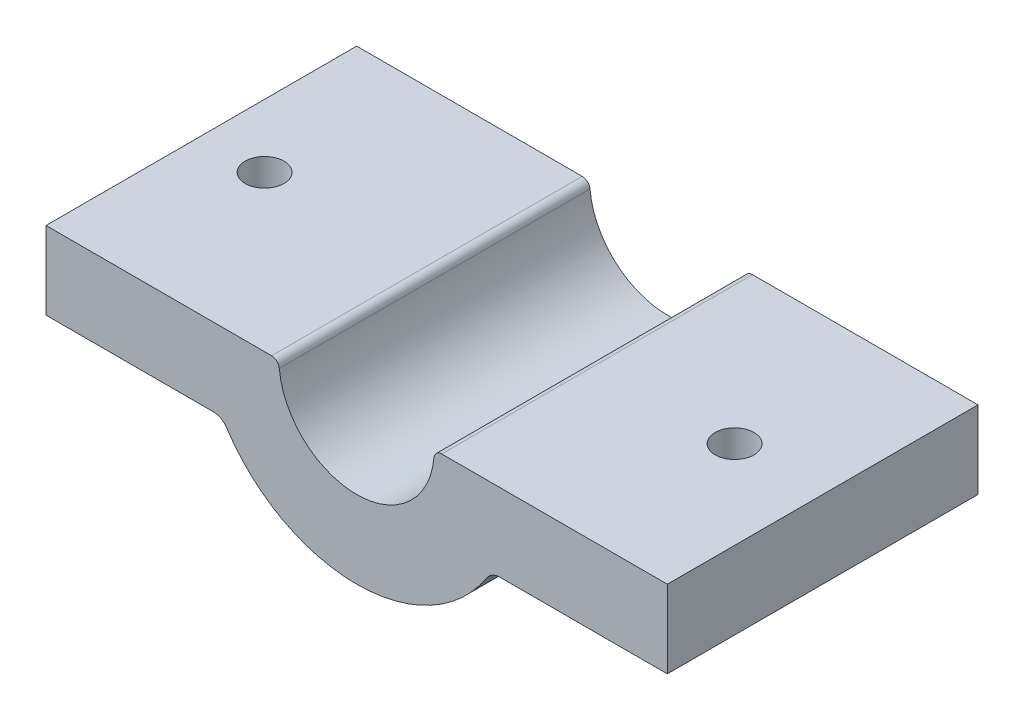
ISO-10303-21;
HEADER;
FILE_DESCRIPTION(('STEP AP214'),'2;1');
FILE_NAME('part.step','',(''),(''),'','','');
FILE_SCHEMA(('AUTOMOTIVE_DESIGN { 1 0 10303 214 1 1 1 1 }'));
ENDSEC;
DATA;
#1=APPLICATION_CONTEXT('core data for automotive mechanical design processes');
#2=APPLICATION_PROTOCOL_DEFINITION('international standard','automotive_design',2000,#1);
#3=PRODUCT_CONTEXT('',#1,'mechanical');
#4=PRODUCT('Part','Part','',(#3));
#5=PRODUCT_RELATED_PRODUCT_CATEGORY('part','',(#4));
#6=PRODUCT_DEFINITION_FORMATION('','',#4);
#7=PRODUCT_DEFINITION_CONTEXT('part definition',#1,'design');
#8=PRODUCT_DEFINITION('design','',#6,#7);
#9=PRODUCT_DEFINITION_SHAPE('','',#8);
#10=(LENGTH_UNIT() NAMED_UNIT(*) SI_UNIT(.MILLI.,.METRE.));
#11=(NAMED_UNIT(*) PLANE_ANGLE_UNIT() SI_UNIT($,.RADIAN.));
#12=(NAMED_UNIT(*) SI_UNIT($,.STERADIAN.) SOLID_ANGLE_UNIT());
#13=UNCERTAINTY_MEASURE_WITH_UNIT(LENGTH_MEASURE(1.E-05),#10,'distance_accuracy_value','');
#14=(GEOMETRIC_REPRESENTATION_CONTEXT(3) GLOBAL_UNCERTAINTY_ASSIGNED_CONTEXT((#13)) GLOBAL_UNIT_ASSIGNED_CONTEXT((#10,
#11,#12)) REPRESENTATION_CONTEXT('',''));
#15=CARTESIAN_POINT('',(0.,0.,0.));
#16=DIRECTION('',(0.,0.,1.));
#17=DIRECTION('',(1.,0.,0.));
#18=AXIS2_PLACEMENT_3D('',#15,#16,#17);
#19=CARTESIAN_POINT('',(-5.47722557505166,-0.5,-20.));
#20=DIRECTION('',(0.,0.,1.));
#21=DIRECTION('',(1.,0.,0.));
#22=AXIS2_PLACEMENT_3D('',#19,#20,#21);
#23=CYLINDRICAL_SURFACE('',#22,0.5);
#24=CARTESIAN_POINT('',(-5.47722557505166,-0.5,0.));
#25=DIRECTION('',(0.,0.,1.));
#26=DIRECTION('',(-1.,0.,0.));
#27=AXIS2_PLACEMENT_3D('',#24,#25,#26);
#28=CIRCLE('',#27,0.5);
#29=CARTESIAN_POINT('',(-4.97929597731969,-0.454545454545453,0.));
#30=VERTEX_POINT('',#29);
#31=CARTESIAN_POINT('',(-5.47722557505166,0.,0.));
#32=VERTEX_POINT('',#31);
#33=EDGE_CURVE('E172',#30,#32,#28,.T.);
#34=ORIENTED_EDGE('',*,*,#33,.F.);
#35=DIRECTION('',(0.,0.,1.));
#36=VECTOR('',#35,1.);
#37=CARTESIAN_POINT('',(-4.97929597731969,-0.454545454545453,-20.));
#38=LINE('',#37,#36);
#39=CARTESIAN_POINT('',(-4.97929597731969,-0.454545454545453,-20.));
#40=VERTEX_POINT('',#39);
#41=EDGE_CURVE('E143',#40,#30,#38,.T.);
#42=ORIENTED_EDGE('',*,*,#41,.F.);
#43=CARTESIAN_POINT('',(-5.47722557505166,-0.5,-20.));
#44=DIRECTION('',(0.,0.,1.));
#45=DIRECTION('',(-1.,0.,0.));
#46=AXIS2_PLACEMENT_3D('',#43,#44,#45);
#47=CIRCLE('',#46,0.5);
#48=CARTESIAN_POINT('',(-5.47722557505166,0.,-20.));
#49=VERTEX_POINT('',#48);
#50=EDGE_CURVE('E137',#40,#49,#47,.T.);
#51=ORIENTED_EDGE('',*,*,#50,.T.);
#52=DIRECTION('',(0.,0.,1.));
#53=VECTOR('',#52,1.);
#54=CARTESIAN_POINT('',(-5.47722557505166,0.,-20.));
#55=LINE('',#54,#53);
#56=EDGE_CURVE('E119',#49,#32,#55,.T.);
#57=ORIENTED_EDGE('',*,*,#56,.T.);
#58=EDGE_LOOP('',(#34,#42,#51,#57));
#59=FACE_BOUND('',#58,.T.);
#60=ADVANCED_FACE('F32',(#59),#23,.T.);
#61=CARTESIAN_POINT('',(0.,0.,-20.));
#62=DIRECTION('',(0.,0.,1.));
#63=DIRECTION('',(1.,0.,0.));
#64=AXIS2_PLACEMENT_3D('',#61,#62,#63);
#65=CYLINDRICAL_SURFACE('',#64,5.);
#66=CARTESIAN_POINT('',(0.,0.,0.));
#67=DIRECTION('',(0.,0.,-1.));
#68=DIRECTION('',(1.,0.,0.));
#69=AXIS2_PLACEMENT_3D('',#66,#67,#68);
#70=CIRCLE('',#69,5.);
#71=CARTESIAN_POINT('',(4.97929597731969,-0.454545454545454,0.));
#72=VERTEX_POINT('',#71);
#73=EDGE_CURVE('E144',#72,#30,#70,.T.);
#74=ORIENTED_EDGE('',*,*,#73,.F.);
#75=DIRECTION('',(0.,0.,1.));
#76=VECTOR('',#75,1.);
#77=CARTESIAN_POINT('',(4.97929597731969,-0.454545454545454,-20.));
#78=LINE('',#77,#76);
#79=CARTESIAN_POINT('',(4.97929597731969,-0.454545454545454,-20.));
#80=VERTEX_POINT('',#79);
#81=EDGE_CURVE('E195',#80,#72,#78,.T.);
#82=ORIENTED_EDGE('',*,*,#81,.F.);
#83=CARTESIAN_POINT('',(0.,0.,-20.));
#84=DIRECTION('',(0.,0.,-1.));
#85=DIRECTION('',(1.,0.,0.));
#86=AXIS2_PLACEMENT_3D('',#83,#84,#85);
#87=CIRCLE('',#86,5.);
#88=EDGE_CURVE('E130',#80,#40,#87,.T.);
#89=ORIENTED_EDGE('',*,*,#88,.T.);
#90=ORIENTED_EDGE('',*,*,#41,.T.);
#91=EDGE_LOOP('',(#74,#82,#89,#90));
#92=FACE_BOUND('',#91,.T.);
#93=ADVANCED_FACE('F254',(#92),#65,.F.);
#94=CARTESIAN_POINT('',(5.47722557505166,-0.5,-20.));
#95=DIRECTION('',(0.,0.,1.));
#96=DIRECTION('',(1.,0.,0.));
#97=AXIS2_PLACEMENT_3D('',#94,#95,#96);
#98=CYLINDRICAL_SURFACE('',#97,0.5);
#99=CARTESIAN_POINT('',(5.47722557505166,-0.5,0.));
#100=DIRECTION('',(0.,0.,1.));
#101=DIRECTION('',(1.,0.,0.));
#102=AXIS2_PLACEMENT_3D('',#99,#100,#101);
#103=CIRCLE('',#102,0.5);
#104=CARTESIAN_POINT('',(5.47722557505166,0.,0.));
#105=VERTEX_POINT('',#104);
#106=EDGE_CURVE('E147',#105,#72,#103,.T.);
#107=ORIENTED_EDGE('',*,*,#106,.F.);
#108=DIRECTION('',(0.,0.,1.));
#109=VECTOR('',#108,1.);
#110=CARTESIAN_POINT('',(5.47722557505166,0.,-20.));
#111=LINE('',#110,#109);
#112=CARTESIAN_POINT('',(5.47722557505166,0.,-20.));
#113=VERTEX_POINT('',#112);
#114=EDGE_CURVE('E197',#113,#105,#111,.T.);
#115=ORIENTED_EDGE('',*,*,#114,.F.);
#116=CARTESIAN_POINT('',(5.47722557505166,-0.5,-20.));
#117=DIRECTION('',(0.,0.,1.));
#118=DIRECTION('',(1.,0.,0.));
#119=AXIS2_PLACEMENT_3D('',#116,#117,#118);
#120=CIRCLE('',#119,0.5);
#121=EDGE_CURVE('E168',#113,#80,#120,.T.);
#122=ORIENTED_EDGE('',*,*,#121,.T.);
#123=ORIENTED_EDGE('',*,*,#81,.T.);
#124=EDGE_LOOP('',(#107,#115,#122,#123));
#125=FACE_BOUND('',#124,.T.);
#126=ADVANCED_FACE('F252',(#125),#98,.T.);
#127=CARTESIAN_POINT('',(5.47722557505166,0.,-20.));
#128=DIRECTION('',(0.,1.,0.));
#129=DIRECTION('',(0.,0.,1.));
#130=AXIS2_PLACEMENT_3D('',#127,#128,#129);
#131=PLANE('',#130);
#132=CARTESIAN_POINT('',(14.3301270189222,0.,-10.));
#133=DIRECTION('',(0.,1.,0.));
#134=DIRECTION('',(0.,0.,1.));
#135=AXIS2_PLACEMENT_3D('',#132,#133,#134);
#136=CIRCLE('',#135,1.25);
#137=CARTESIAN_POINT('',(14.3301270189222,0.,-8.75));
#138=VERTEX_POINT('',#137);
#139=EDGE_CURVE('E150',#138,#138,#136,.T.);
#140=ORIENTED_EDGE('',*,*,#139,.F.);
#141=EDGE_LOOP('',(#140));
#142=FACE_BOUND('',#141,.T.);
#143=DIRECTION('',(-1.,0.,0.));
#144=VECTOR('',#143,1.);
#145=CARTESIAN_POINT('',(5.47722557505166,0.,0.));
#146=LINE('',#145,#144);
#147=CARTESIAN_POINT('',(20.,0.,0.));
#148=VERTEX_POINT('',#147);
#149=EDGE_CURVE('E188',#148,#105,#146,.T.);
#150=ORIENTED_EDGE('',*,*,#149,.F.);
#151=DIRECTION('',(0.,0.,1.));
#152=VECTOR('',#151,1.);
#153=CARTESIAN_POINT('',(20.,0.,-20.));
#154=LINE('',#153,#152);
#155=CARTESIAN_POINT('',(20.,0.,-20.));
#156=VERTEX_POINT('',#155);
#157=EDGE_CURVE('E199',#156,#148,#154,.T.);
#158=ORIENTED_EDGE('',*,*,#157,.F.);
#159=DIRECTION('',(-1.,0.,0.));
#160=VECTOR('',#159,1.);
#161=CARTESIAN_POINT('',(5.47722557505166,0.,-20.));
#162=LINE('',#161,#160);
#163=EDGE_CURVE('E165',#156,#113,#162,.T.);
#164=ORIENTED_EDGE('',*,*,#163,.T.);
#165=ORIENTED_EDGE('',*,*,#114,.T.);
#166=EDGE_LOOP('',(#150,#158,#164,#165));
#167=FACE_BOUND('',#166,.T.);
#168=ADVANCED_FACE('F249',(#142,#167),#131,.T.);
#169=CARTESIAN_POINT('',(20.,0.,-20.));
#170=DIRECTION('',(1.,0.,0.));
#171=DIRECTION('',(0.,0.,-1.));
#172=AXIS2_PLACEMENT_3D('',#169,#170,#171);
#173=PLANE('',#172);
#174=DIRECTION('',(0.,1.,0.));
#175=VECTOR('',#174,1.);
#176=CARTESIAN_POINT('',(20.,0.,0.));
#177=LINE('',#176,#175);
#178=CARTESIAN_POINT('',(20.,-5.,0.));
#179=VERTEX_POINT('',#178);
#180=EDGE_CURVE('E185',#179,#148,#177,.T.);
#181=ORIENTED_EDGE('',*,*,#180,.F.);
#182=DIRECTION('',(0.,0.,1.));
#183=VECTOR('',#182,1.);
#184=CARTESIAN_POINT('',(20.,-5.,-20.));
#185=LINE('',#184,#183);
#186=CARTESIAN_POINT('',(20.,-5.,-20.));
#187=VERTEX_POINT('',#186);
#188=EDGE_CURVE('E201',#187,#179,#185,.T.);
#189=ORIENTED_EDGE('',*,*,#188,.F.);
#190=DIRECTION('',(0.,1.,0.));
#191=VECTOR('',#190,1.);
#192=CARTESIAN_POINT('',(20.,0.,-20.));
#193=LINE('',#192,#191);
#194=EDGE_CURVE('E162',#187,#156,#193,.T.);
#195=ORIENTED_EDGE('',*,*,#194,.T.);
#196=ORIENTED_EDGE('',*,*,#157,.T.);
#197=EDGE_LOOP('',(#181,#189,#195,#196));
#198=FACE_BOUND('',#197,.T.);
#199=ADVANCED_FACE('F244',(#198),#173,.T.);
#200=CARTESIAN_POINT('',(8.66025403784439,-5.,-20.));
#201=DIRECTION('',(0.,-1.,0.));
#202=DIRECTION('',(0.,0.,-1.));
#203=AXIS2_PLACEMENT_3D('',#200,#201,#202);
#204=PLANE('',#203);
#205=CARTESIAN_POINT('',(14.3301270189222,-5.,-10.));
#206=DIRECTION('',(0.,-1.,0.));
#207=DIRECTION('',(0.,0.,-1.));
#208=AXIS2_PLACEMENT_3D('',#205,#206,#207);
#209=CIRCLE('',#208,1.25);
#210=CARTESIAN_POINT('',(14.3301270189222,-5.,-11.25));
#211=VERTEX_POINT('',#210);
#212=EDGE_CURVE('E396',#211,#211,#209,.T.);
#213=ORIENTED_EDGE('',*,*,#212,.F.);
#214=EDGE_LOOP('',(#213));
#215=FACE_BOUND('',#214,.T.);
#216=DIRECTION('',(1.,0.,0.));
#217=VECTOR('',#216,1.);
#218=CARTESIAN_POINT('',(8.66025403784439,-5.,0.));
#219=LINE('',#218,#217);
#220=CARTESIAN_POINT('',(9.21954445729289,-5.,0.));
#221=VERTEX_POINT('',#220);
#222=EDGE_CURVE('E183',#221,#179,#219,.T.);
#223=ORIENTED_EDGE('',*,*,#222,.F.);
#224=DIRECTION('',(0.,0.,-1.));
#225=VECTOR('',#224,1.);
#226=CARTESIAN_POINT('',(9.21954445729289,-5.,-20.));
#227=LINE('',#226,#225);
#228=CARTESIAN_POINT('',(9.21954445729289,-5.,-20.));
#229=VERTEX_POINT('',#228);
#230=EDGE_CURVE('E47',#221,#229,#227,.T.);
#231=ORIENTED_EDGE('',*,*,#230,.T.);
#232=DIRECTION('',(1.,0.,0.));
#233=VECTOR('',#232,1.);
#234=CARTESIAN_POINT('',(8.66025403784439,-5.,-20.));
#235=LINE('',#234,#233);
#236=EDGE_CURVE('E160',#229,#187,#235,.T.);
#237=ORIENTED_EDGE('',*,*,#236,.T.);
#238=ORIENTED_EDGE('',*,*,#188,.T.);
#239=EDGE_LOOP('',(#223,#231,#237,#238));
#240=FACE_BOUND('',#239,.T.);
#241=ADVANCED_FACE('F241',(#215,#240),#204,.T.);
#242=CARTESIAN_POINT('',(0.,0.,-20.));
#243=DIRECTION('',(0.,0.,1.));
#244=DIRECTION('',(1.,0.,0.));
#245=AXIS2_PLACEMENT_3D('',#242,#243,#244);
#246=CYLINDRICAL_SURFACE('',#245,10.);
#247=CARTESIAN_POINT('',(0.,0.,0.));
#248=DIRECTION('',(0.,0.,1.));
#249=DIRECTION('',(1.,0.,0.));
#250=AXIS2_PLACEMENT_3D('',#247,#248,#249);
#251=CIRCLE('',#250,10.);
#252=CARTESIAN_POINT('',(-8.38140405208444,-5.45454545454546,0.));
#253=VERTEX_POINT('',#252);
#254=CARTESIAN_POINT('',(8.38140405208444,-5.45454545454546,0.));
#255=VERTEX_POINT('',#254);
#256=EDGE_CURVE('E181',#253,#255,#251,.T.);
#257=ORIENTED_EDGE('',*,*,#256,.F.);
#258=DIRECTION('',(0.,0.,1.));
#259=VECTOR('',#258,1.);
#260=CARTESIAN_POINT('',(-8.38140405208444,-5.45454545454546,-20.));
#261=LINE('',#260,#259);
#262=CARTESIAN_POINT('',(-8.38140405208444,-5.45454545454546,-20.));
#263=VERTEX_POINT('',#262);
#264=EDGE_CURVE('E216',#253,#263,#261,.F.);
#265=ORIENTED_EDGE('',*,*,#264,.T.);
#266=CARTESIAN_POINT('',(0.,0.,-20.));
#267=DIRECTION('',(0.,0.,1.));
#268=DIRECTION('',(1.,0.,0.));
#269=AXIS2_PLACEMENT_3D('',#266,#267,#268);
#270=CIRCLE('',#269,10.);
#271=CARTESIAN_POINT('',(8.38140405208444,-5.45454545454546,-20.));
#272=VERTEX_POINT('',#271);
#273=EDGE_CURVE('E157',#263,#272,#270,.T.);
#274=ORIENTED_EDGE('',*,*,#273,.T.);
#275=DIRECTION('',(0.,0.,1.));
#276=VECTOR('',#275,1.);
#277=CARTESIAN_POINT('',(8.38140405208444,-5.45454545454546,-20.));
#278=LINE('',#277,#276);
#279=EDGE_CURVE('E213',#272,#255,#278,.T.);
#280=ORIENTED_EDGE('',*,*,#279,.T.);
#281=EDGE_LOOP('',(#257,#265,#274,#280));
#282=FACE_BOUND('',#281,.T.);
#283=ADVANCED_FACE('F234',(#282),#246,.T.);
#284=CARTESIAN_POINT('',(-8.66025403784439,-5.,-20.));
#285=DIRECTION('',(0.,-1.,0.));
#286=DIRECTION('',(1.,0.,0.));
#287=AXIS2_PLACEMENT_3D('',#284,#285,#286);
#288=PLANE('',#287);
#289=CARTESIAN_POINT('',(-15.928078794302,-5.,-10.));
#290=DIRECTION('',(0.,-1.,0.));
#291=DIRECTION('',(0.,0.,-1.));
#292=AXIS2_PLACEMENT_3D('',#289,#290,#291);
#293=CIRCLE('',#292,1.25);
#294=CARTESIAN_POINT('',(-15.928078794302,-5.,-11.25));
#295=VERTEX_POINT('',#294);
#296=EDGE_CURVE('E210',#295,#295,#293,.T.);
#297=ORIENTED_EDGE('',*,*,#296,.F.);
#298=EDGE_LOOP('',(#297));
#299=FACE_BOUND('',#298,.T.);
#300=DIRECTION('',(1.,0.,0.));
#301=VECTOR('',#300,1.);
#302=CARTESIAN_POINT('',(-8.66025403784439,-5.,-20.));
#303=LINE('',#302,#301);
#304=CARTESIAN_POINT('',(-20.,-5.,-20.));
#305=VERTEX_POINT('',#304);
#306=CARTESIAN_POINT('',(-9.21954445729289,-5.,-20.));
#307=VERTEX_POINT('',#306);
#308=EDGE_CURVE('E154',#305,#307,#303,.T.);
#309=ORIENTED_EDGE('',*,*,#308,.T.);
#310=DIRECTION('',(0.,0.,-1.));
#311=VECTOR('',#310,1.);
#312=CARTESIAN_POINT('',(-9.21954445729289,-5.,0.));
#313=LINE('',#312,#311);
#314=CARTESIAN_POINT('',(-9.21954445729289,-5.,0.));
#315=VERTEX_POINT('',#314);
#316=EDGE_CURVE('E194',#307,#315,#313,.F.);
#317=ORIENTED_EDGE('',*,*,#316,.T.);
#318=DIRECTION('',(1.,0.,0.));
#319=VECTOR('',#318,1.);
#320=CARTESIAN_POINT('',(-8.66025403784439,-5.,0.));
#321=LINE('',#320,#319);
#322=CARTESIAN_POINT('',(-20.,-5.,0.));
#323=VERTEX_POINT('',#322);
#324=EDGE_CURVE('E178',#323,#315,#321,.T.);
#325=ORIENTED_EDGE('',*,*,#324,.F.);
#326=DIRECTION('',(0.,0.,1.));
#327=VECTOR('',#326,1.);
#328=CARTESIAN_POINT('',(-20.,-5.,-20.));
#329=LINE('',#328,#327);
#330=EDGE_CURVE('E204',#305,#323,#329,.T.);
#331=ORIENTED_EDGE('',*,*,#330,.F.);
#332=EDGE_LOOP('',(#309,#317,#325,#331));
#333=FACE_BOUND('',#332,.T.);
#334=ADVANCED_FACE('F228',(#299,#333),#288,.T.);
#335=CARTESIAN_POINT('',(-20.,0.,-20.));
#336=DIRECTION('',(-1.,0.,0.));
#337=DIRECTION('',(0.,0.,1.));
#338=AXIS2_PLACEMENT_3D('',#335,#336,#337);
#339=PLANE('',#338);
#340=DIRECTION('',(0.,-1.,0.));
#341=VECTOR('',#340,1.);
#342=CARTESIAN_POINT('',(-20.,0.,0.));
#343=LINE('',#342,#341);
#344=CARTESIAN_POINT('',(-20.,0.,0.));
#345=VERTEX_POINT('',#344);
#346=EDGE_CURVE('E175',#345,#323,#343,.T.);
#347=ORIENTED_EDGE('',*,*,#346,.F.);
#348=DIRECTION('',(0.,0.,1.));
#349=VECTOR('',#348,1.);
#350=CARTESIAN_POINT('',(-20.,0.,-20.));
#351=LINE('',#350,#349);
#352=CARTESIAN_POINT('',(-20.,0.,-20.));
#353=VERTEX_POINT('',#352);
#354=EDGE_CURVE('E129',#353,#345,#351,.T.);
#355=ORIENTED_EDGE('',*,*,#354,.F.);
#356=DIRECTION('',(0.,-1.,0.));
#357=VECTOR('',#356,1.);
#358=CARTESIAN_POINT('',(-20.,0.,-20.));
#359=LINE('',#358,#357);
#360=EDGE_CURVE('E141',#353,#305,#359,.T.);
#361=ORIENTED_EDGE('',*,*,#360,.T.);
#362=ORIENTED_EDGE('',*,*,#330,.T.);
#363=EDGE_LOOP('',(#347,#355,#361,#362));
#364=FACE_BOUND('',#363,.T.);
#365=ADVANCED_FACE('F257',(#364),#339,.T.);
#366=CARTESIAN_POINT('',(-5.47722557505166,0.,-20.));
#367=DIRECTION('',(0.,1.,0.));
#368=DIRECTION('',(-1.,0.,0.));
#369=AXIS2_PLACEMENT_3D('',#366,#367,#368);
#370=PLANE('',#369);
#371=CARTESIAN_POINT('',(-15.928078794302,0.,-10.));
#372=DIRECTION('',(0.,1.,0.));
#373=DIRECTION('',(-1.,0.,0.));
#374=AXIS2_PLACEMENT_3D('',#371,#372,#373);
#375=CIRCLE('',#374,1.25);
#376=CARTESIAN_POINT('',(-17.178078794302,0.,-10.));
#377=VERTEX_POINT('',#376);
#378=EDGE_CURVE('E207',#377,#377,#375,.T.);
#379=ORIENTED_EDGE('',*,*,#378,.F.);
#380=EDGE_LOOP('',(#379));
#381=FACE_BOUND('',#380,.T.);
#382=DIRECTION('',(-1.,0.,0.));
#383=VECTOR('',#382,1.);
#384=CARTESIAN_POINT('',(-5.47722557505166,0.,0.));
#385=LINE('',#384,#383);
#386=EDGE_CURVE('E124',#32,#345,#385,.T.);
#387=ORIENTED_EDGE('',*,*,#386,.F.);
#388=ORIENTED_EDGE('',*,*,#56,.F.);
#389=DIRECTION('',(-1.,0.,0.));
#390=VECTOR('',#389,1.);
#391=CARTESIAN_POINT('',(-5.47722557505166,0.,-20.));
#392=LINE('',#391,#390);
#393=EDGE_CURVE('E122',#49,#353,#392,.T.);
#394=ORIENTED_EDGE('',*,*,#393,.T.);
#395=ORIENTED_EDGE('',*,*,#354,.T.);
#396=EDGE_LOOP('',(#387,#388,#394,#395));
#397=FACE_BOUND('',#396,.T.);
#398=ADVANCED_FACE('F121',(#381,#397),#370,.T.);
#399=CARTESIAN_POINT('',(-5.47722557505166,-0.5,-20.));
#400=DIRECTION('',(0.,0.,-1.));
#401=DIRECTION('',(-1.,0.,0.));
#402=AXIS2_PLACEMENT_3D('',#399,#400,#401);
#403=PLANE('',#402);
#404=ORIENTED_EDGE('',*,*,#50,.F.);
#405=ORIENTED_EDGE('',*,*,#88,.F.);
#406=ORIENTED_EDGE('',*,*,#121,.F.);
#407=ORIENTED_EDGE('',*,*,#163,.F.);
#408=ORIENTED_EDGE('',*,*,#194,.F.);
#409=ORIENTED_EDGE('',*,*,#236,.F.);
#410=CARTESIAN_POINT('',(9.21954445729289,-6.,-20.));
#411=DIRECTION('',(0.,0.,-1.));
#412=DIRECTION('',(-1.,0.,0.));
#413=AXIS2_PLACEMENT_3D('',#410,#411,#412);
#414=CIRCLE('',#413,1.);
#415=EDGE_CURVE('E11',#229,#272,#414,.F.);
#416=ORIENTED_EDGE('',*,*,#415,.T.);
#417=ORIENTED_EDGE('',*,*,#273,.F.);
#418=CARTESIAN_POINT('',(-9.21954445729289,-6.,-20.));
#419=DIRECTION('',(0.,0.,-1.));
#420=DIRECTION('',(-1.,0.,0.));
#421=AXIS2_PLACEMENT_3D('',#418,#419,#420);
#422=CIRCLE('',#421,1.);
#423=EDGE_CURVE('E221',#263,#307,#422,.F.);
#424=ORIENTED_EDGE('',*,*,#423,.T.);
#425=ORIENTED_EDGE('',*,*,#308,.F.);
#426=ORIENTED_EDGE('',*,*,#360,.F.);
#427=ORIENTED_EDGE('',*,*,#393,.F.);
#428=EDGE_LOOP('',(#404,#405,#406,#407,#408,#409,#416,#417,#424,#425,#426,#427));
#429=FACE_BOUND('',#428,.T.);
#430=ADVANCED_FACE('F135',(#429),#403,.T.);
#431=CARTESIAN_POINT('',(-5.47722557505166,-0.5,0.));
#432=DIRECTION('',(0.,0.,-1.));
#433=DIRECTION('',(-1.,0.,0.));
#434=AXIS2_PLACEMENT_3D('',#431,#432,#433);
#435=PLANE('',#434);
#436=ORIENTED_EDGE('',*,*,#33,.T.);
#437=ORIENTED_EDGE('',*,*,#386,.T.);
#438=ORIENTED_EDGE('',*,*,#346,.T.);
#439=ORIENTED_EDGE('',*,*,#324,.T.);
#440=CARTESIAN_POINT('',(-9.21954445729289,-6.,0.));
#441=DIRECTION('',(0.,0.,-1.));
#442=DIRECTION('',(-1.,0.,0.));
#443=AXIS2_PLACEMENT_3D('',#440,#441,#442);
#444=CIRCLE('',#443,1.);
#445=EDGE_CURVE('E219',#315,#253,#444,.T.);
#446=ORIENTED_EDGE('',*,*,#445,.T.);
#447=ORIENTED_EDGE('',*,*,#256,.T.);
#448=CARTESIAN_POINT('',(9.21954445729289,-6.,0.));
#449=DIRECTION('',(0.,0.,-1.));
#450=DIRECTION('',(-1.,0.,0.));
#451=AXIS2_PLACEMENT_3D('',#448,#449,#450);
#452=CIRCLE('',#451,1.);
#453=EDGE_CURVE('E40',#255,#221,#452,.T.);
#454=ORIENTED_EDGE('',*,*,#453,.T.);
#455=ORIENTED_EDGE('',*,*,#222,.T.);
#456=ORIENTED_EDGE('',*,*,#180,.T.);
#457=ORIENTED_EDGE('',*,*,#149,.T.);
#458=ORIENTED_EDGE('',*,*,#106,.T.);
#459=ORIENTED_EDGE('',*,*,#73,.T.);
#460=EDGE_LOOP('',(#436,#437,#438,#439,#446,#447,#454,#455,#456,#457,#458,#459));
#461=FACE_BOUND('',#460,.T.);
#462=ADVANCED_FACE('F232',(#461),#435,.F.);
#463=CARTESIAN_POINT('',(-15.928078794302,15.,-10.));
#464=DIRECTION('',(0.,-1.,0.));
#465=DIRECTION('',(0.,0.,-1.));
#466=AXIS2_PLACEMENT_3D('',#463,#464,#465);
#467=CYLINDRICAL_SURFACE('',#466,1.25);
#468=ORIENTED_EDGE('',*,*,#378,.T.);
#469=EDGE_LOOP('',(#468));
#470=FACE_BOUND('',#469,.T.);
#471=ORIENTED_EDGE('',*,*,#296,.T.);
#472=EDGE_LOOP('',(#471));
#473=FACE_BOUND('',#472,.T.);
#474=ADVANCED_FACE('F280',(#470,#473),#467,.F.);
#475=CARTESIAN_POINT('',(14.3301270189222,15.,-10.));
#476=DIRECTION('',(0.,-1.,0.));
#477=DIRECTION('',(0.,0.,-1.));
#478=AXIS2_PLACEMENT_3D('',#475,#476,#477);
#479=CYLINDRICAL_SURFACE('',#478,1.25);
#480=ORIENTED_EDGE('',*,*,#139,.T.);
#481=EDGE_LOOP('',(#480));
#482=FACE_BOUND('',#481,.T.);
#483=ORIENTED_EDGE('',*,*,#212,.T.);
#484=EDGE_LOOP('',(#483));
#485=FACE_BOUND('',#484,.T.);
#486=ADVANCED_FACE('F275',(#482,#485),#479,.F.);
#487=CARTESIAN_POINT('',(-9.21954445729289,-6.,-20.));
#488=DIRECTION('',(0.,0.,1.));
#489=DIRECTION('',(1.,0.,0.));
#490=AXIS2_PLACEMENT_3D('',#487,#488,#489);
#491=CYLINDRICAL_SURFACE('',#490,1.);
#492=ORIENTED_EDGE('',*,*,#423,.F.);
#493=ORIENTED_EDGE('',*,*,#264,.F.);
#494=ORIENTED_EDGE('',*,*,#445,.F.);
#495=ORIENTED_EDGE('',*,*,#316,.F.);
#496=EDGE_LOOP('',(#492,#493,#494,#495));
#497=FACE_BOUND('',#496,.T.);
#498=ADVANCED_FACE('F230',(#497),#491,.F.);
#499=CARTESIAN_POINT('',(9.21954445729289,-6.,-20.));
#500=DIRECTION('',(0.,0.,1.));
#501=DIRECTION('',(1.,0.,0.));
#502=AXIS2_PLACEMENT_3D('',#499,#500,#501);
#503=CYLINDRICAL_SURFACE('',#502,1.);
#504=ORIENTED_EDGE('',*,*,#415,.F.);
#505=ORIENTED_EDGE('',*,*,#230,.F.);
#506=ORIENTED_EDGE('',*,*,#453,.F.);
#507=ORIENTED_EDGE('',*,*,#279,.F.);
#508=EDGE_LOOP('',(#504,#505,#506,#507));
#509=FACE_BOUND('',#508,.T.);
#510=ADVANCED_FACE('F34',(#509),#503,.F.);
#511=CLOSED_SHELL('',(#60,#93,#126,#168,#199,#241,#283,#334,#365,#398,#430,#462,#474,#486,#498,#510));
#512=MANIFOLD_SOLID_BREP('B2',#511);
#513=ADVANCED_BREP_SHAPE_REPRESENTATION('',(#18,#512),#14);
#514=SHAPE_DEFINITION_REPRESENTATION(#9,#513);
ENDSEC;
END-ISO-10303-21;
